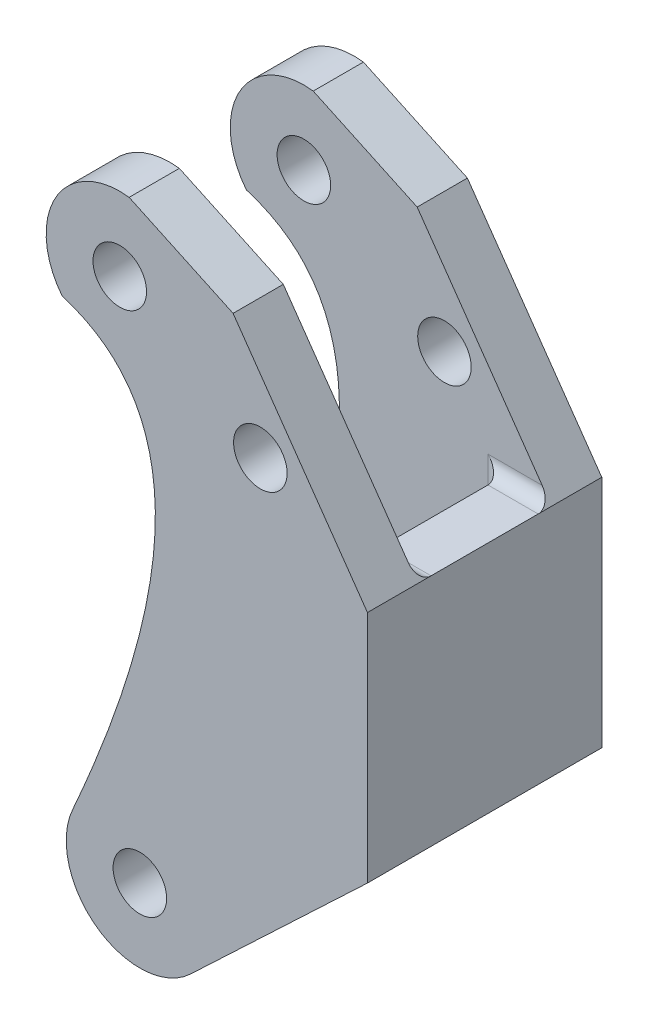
ISO-10303-21;
HEADER;
FILE_DESCRIPTION(('STEP AP214'),'2;1');
FILE_NAME('part.step','',(''),(''),'','','');
FILE_SCHEMA(('AUTOMOTIVE_DESIGN { 1 0 10303 214 1 1 1 1 }'));
ENDSEC;
DATA;
#1=APPLICATION_CONTEXT('core data for automotive mechanical design processes');
#2=APPLICATION_PROTOCOL_DEFINITION('international standard','automotive_design',2000,#1);
#3=PRODUCT_CONTEXT('',#1,'mechanical');
#4=PRODUCT('Part','Part','',(#3));
#5=PRODUCT_RELATED_PRODUCT_CATEGORY('part','',(#4));
#6=PRODUCT_DEFINITION_FORMATION('','',#4);
#7=PRODUCT_DEFINITION_CONTEXT('part definition',#1,'design');
#8=PRODUCT_DEFINITION('design','',#6,#7);
#9=PRODUCT_DEFINITION_SHAPE('','',#8);
#10=(LENGTH_UNIT() NAMED_UNIT(*) SI_UNIT(.MILLI.,.METRE.));
#11=(NAMED_UNIT(*) PLANE_ANGLE_UNIT() SI_UNIT($,.RADIAN.));
#12=(NAMED_UNIT(*) SI_UNIT($,.STERADIAN.) SOLID_ANGLE_UNIT());
#13=UNCERTAINTY_MEASURE_WITH_UNIT(LENGTH_MEASURE(1.E-05),#10,'distance_accuracy_value','');
#14=(GEOMETRIC_REPRESENTATION_CONTEXT(3) GLOBAL_UNCERTAINTY_ASSIGNED_CONTEXT((#13)) GLOBAL_UNIT_ASSIGNED_CONTEXT((#10,
#11,#12)) REPRESENTATION_CONTEXT('',''));
#15=CARTESIAN_POINT('',(0.,0.,0.));
#16=DIRECTION('',(0.,0.,1.));
#17=DIRECTION('',(1.,0.,0.));
#18=AXIS2_PLACEMENT_3D('',#15,#16,#17);
#19=CARTESIAN_POINT('',(-733376.145202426,-679839.483721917,35.));
#20=CARTESIAN_POINT('',(729354.890660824,684144.097201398,35.));
#21=CARTESIAN_POINT('',(-725481.74701469,-688256.591366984,35.));
#22=B_SPLINE_CURVE_WITH_KNOTS('',2,(#19,#20,#21),.UNSPECIFIED.,.F.,.F.,(3,3),(0.,1.),.UNSPECIFIED.);
#23=DIRECTION('',(0.,0.,-1.));
#24=VECTOR('',#23,1.);
#25=SURFACE_OF_LINEAR_EXTRUSION('',#22,#24);
#26=CARTESIAN_POINT('',(-733376.145202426,-679839.483721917,27.5));
#27=CARTESIAN_POINT('',(729354.890660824,684144.097201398,27.5));
#28=CARTESIAN_POINT('',(-725481.74701469,-688256.591366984,27.5));
#29=B_SPLINE_CURVE_WITH_KNOTS('',2,(#26,#27,#28),.UNSPECIFIED.,.F.,.F.,(3,3),(0.,1.),.UNSPECIFIED.);
#30=CARTESIAN_POINT('',(-45.5921431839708,53.1315885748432,27.5));
#31=VERTEX_POINT('',#30);
#32=CARTESIAN_POINT('',(-44.033482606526,-12.4912056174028,27.5));
#33=VERTEX_POINT('',#32);
#34=EDGE_CURVE('E236',#31,#33,#29,.T.);
#35=ORIENTED_EDGE('',*,*,#34,.T.);
#36=DIRECTION('',(0.,0.,-1.));
#37=VECTOR('',#36,1.);
#38=CARTESIAN_POINT('',(-44.0334826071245,-12.4912056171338,35.));
#39=LINE('',#38,#37);
#40=CARTESIAN_POINT('',(-44.0334826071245,-12.4912056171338,35.));
#41=VERTEX_POINT('',#40);
#42=EDGE_CURVE('E209',#41,#33,#39,.T.);
#43=ORIENTED_EDGE('',*,*,#42,.F.);
#44=CARTESIAN_POINT('',(-45.5921431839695,53.1315885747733,35.));
#45=VERTEX_POINT('',#44);
#46=EDGE_CURVE('E199',#45,#41,#22,.T.);
#47=ORIENTED_EDGE('',*,*,#46,.F.);
#48=DIRECTION('',(0.,0.,-1.));
#49=VECTOR('',#48,1.);
#50=CARTESIAN_POINT('',(-45.5921431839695,53.1315885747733,35.));
#51=LINE('',#50,#49);
#52=EDGE_CURVE('E216',#45,#31,#51,.T.);
#53=ORIENTED_EDGE('',*,*,#52,.T.);
#54=EDGE_LOOP('',(#35,#43,#47,#53));
#55=FACE_BOUND('',#54,.T.);
#56=ADVANCED_FACE('F34',(#55),#25,.F.);
#57=CARTESIAN_POINT('',(0.,0.,35.));
#58=DIRECTION('',(-0.686903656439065,0.726748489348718,0.));
#59=DIRECTION('',(-0.726748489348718,-0.686903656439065,0.));
#60=AXIS2_PLACEMENT_3D('',#57,#58,#59);
#61=PLANE('',#60);
#62=DIRECTION('',(0.,0.,-1.));
#63=VECTOR('',#62,1.);
#64=CARTESIAN_POINT('',(-26.4440597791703,-24.9942333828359,35.));
#65=LINE('',#64,#63);
#66=CARTESIAN_POINT('',(-26.4440597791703,-24.9942333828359,35.));
#67=VERTEX_POINT('',#66);
#68=CARTESIAN_POINT('',(-26.4440597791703,-24.9942333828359,27.5));
#69=VERTEX_POINT('',#68);
#70=EDGE_CURVE('E198',#67,#69,#65,.T.);
#71=ORIENTED_EDGE('',*,*,#70,.T.);
#72=DIRECTION('',(0.726748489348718,0.686903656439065,0.));
#73=VECTOR('',#72,1.);
#74=CARTESIAN_POINT('',(0.,0.,27.5));
#75=LINE('',#74,#73);
#76=CARTESIAN_POINT('',(-2.11601287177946,-2.,27.5));
#77=VERTEX_POINT('',#76);
#78=EDGE_CURVE('E421',#69,#77,#75,.T.);
#79=ORIENTED_EDGE('',*,*,#78,.T.);
#80=CARTESIAN_POINT('',(-2.11601287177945,-2.,25.5));
#81=DIRECTION('',(-0.686903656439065,0.726748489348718,0.));
#82=DIRECTION('',(-0.726748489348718,-0.686903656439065,0.));
#83=AXIS2_PLACEMENT_3D('',#80,#81,#82);
#84=ELLIPSE('',#83,2.91161647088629,2.);
#85=CARTESIAN_POINT('',(0.,0.,25.5));
#86=VERTEX_POINT('',#85);
#87=EDGE_CURVE('E289',#77,#86,#84,.T.);
#88=ORIENTED_EDGE('',*,*,#87,.T.);
#89=DIRECTION('',(0.,0.,-1.));
#90=VECTOR('',#89,1.);
#91=CARTESIAN_POINT('',(0.,0.,35.));
#92=LINE('',#91,#90);
#93=CARTESIAN_POINT('',(0.,0.,35.));
#94=VERTEX_POINT('',#93);
#95=EDGE_CURVE('E230',#94,#86,#92,.T.);
#96=ORIENTED_EDGE('',*,*,#95,.F.);
#97=DIRECTION('',(0.726748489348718,0.686903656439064,0.));
#98=VECTOR('',#97,1.);
#99=CARTESIAN_POINT('',(0.,0.,35.));
#100=LINE('',#99,#98);
#101=EDGE_CURVE('E341',#67,#94,#100,.T.);
#102=ORIENTED_EDGE('',*,*,#101,.F.);
#103=EDGE_LOOP('',(#71,#79,#88,#96,#102));
#104=FACE_BOUND('',#103,.T.);
#105=ADVANCED_FACE('F384',(#104),#61,.F.);
#106=CARTESIAN_POINT('',(-34.,-17.,35.));
#107=DIRECTION('',(0.,0.,-1.));
#108=DIRECTION('',(-1.,0.,0.));
#109=AXIS2_PLACEMENT_3D('',#106,#107,#108);
#110=CYLINDRICAL_SURFACE('',#109,11.);
#111=ORIENTED_EDGE('',*,*,#42,.T.);
#112=CARTESIAN_POINT('',(-34.,-17.,27.5));
#113=DIRECTION('',(0.,0.,1.));
#114=DIRECTION('',(1.,0.,0.));
#115=AXIS2_PLACEMENT_3D('',#112,#113,#114);
#116=CIRCLE('',#115,11.);
#117=EDGE_CURVE('E248',#33,#69,#116,.T.);
#118=ORIENTED_EDGE('',*,*,#117,.T.);
#119=ORIENTED_EDGE('',*,*,#70,.F.);
#120=CARTESIAN_POINT('',(-34.,-17.,35.));
#121=DIRECTION('',(0.,0.,1.));
#122=DIRECTION('',(1.,0.,0.));
#123=AXIS2_PLACEMENT_3D('',#120,#121,#122);
#124=CIRCLE('',#123,11.);
#125=EDGE_CURVE('E196',#41,#67,#124,.T.);
#126=ORIENTED_EDGE('',*,*,#125,.F.);
#127=EDGE_LOOP('',(#111,#118,#119,#126));
#128=FACE_BOUND('',#127,.T.);
#129=ADVANCED_FACE('F411',(#128),#110,.T.);
#130=CARTESIAN_POINT('',(0.,35.,35.));
#131=DIRECTION('',(-0.819152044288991,-0.573576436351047,0.));
#132=DIRECTION('',(0.573576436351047,-0.819152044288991,0.));
#133=AXIS2_PLACEMENT_3D('',#130,#131,#132);
#134=PLANE('',#133);
#135=DIRECTION('',(0.,0.,-1.));
#136=VECTOR('',#135,1.);
#137=CARTESIAN_POINT('',(0.,35.,35.));
#138=LINE('',#137,#136);
#139=CARTESIAN_POINT('',(0.,35.,35.));
#140=VERTEX_POINT('',#139);
#141=CARTESIAN_POINT('',(0.,35.,25.5));
#142=VERTEX_POINT('',#141);
#143=EDGE_CURVE('E227',#140,#142,#138,.T.);
#144=ORIENTED_EDGE('',*,*,#143,.T.);
#145=CARTESIAN_POINT('',(-1.40041507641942,37.,25.5));
#146=DIRECTION('',(-0.819152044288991,-0.573576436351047,0.));
#147=DIRECTION('',(-0.573576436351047,0.819152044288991,0.));
#148=AXIS2_PLACEMENT_3D('',#145,#146,#147);
#149=ELLIPSE('',#148,2.44154917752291,2.);
#150=CARTESIAN_POINT('',(-1.40041507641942,37.,27.5));
#151=VERTEX_POINT('',#150);
#152=EDGE_CURVE('E287',#142,#151,#149,.T.);
#153=ORIENTED_EDGE('',*,*,#152,.T.);
#154=DIRECTION('',(-0.573576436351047,0.819152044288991,0.));
#155=VECTOR('',#154,1.);
#156=CARTESIAN_POINT('',(0.,35.,27.5));
#157=LINE('',#156,#155);
#158=CARTESIAN_POINT('',(-20.0751752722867,63.6703215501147,27.5));
#159=VERTEX_POINT('',#158);
#160=EDGE_CURVE('E338',#151,#159,#157,.T.);
#161=ORIENTED_EDGE('',*,*,#160,.T.);
#162=DIRECTION('',(0.,0.,-1.));
#163=VECTOR('',#162,1.);
#164=CARTESIAN_POINT('',(-20.0751752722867,63.6703215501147,35.));
#165=LINE('',#164,#163);
#166=CARTESIAN_POINT('',(-20.0751752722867,63.6703215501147,35.));
#167=VERTEX_POINT('',#166);
#168=EDGE_CURVE('E224',#167,#159,#165,.T.);
#169=ORIENTED_EDGE('',*,*,#168,.F.);
#170=DIRECTION('',(-0.573576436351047,0.819152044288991,0.));
#171=VECTOR('',#170,1.);
#172=CARTESIAN_POINT('',(0.,35.,35.));
#173=LINE('',#172,#171);
#174=EDGE_CURVE('E346',#140,#167,#173,.T.);
#175=ORIENTED_EDGE('',*,*,#174,.F.);
#176=EDGE_LOOP('',(#144,#153,#161,#169,#175));
#177=FACE_BOUND('',#176,.T.);
#178=ADVANCED_FACE('F379',(#177),#134,.F.);
#179=CARTESIAN_POINT('',(-20.0751752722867,63.6703215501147,35.));
#180=DIRECTION('',(-0.422618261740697,-0.906307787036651,0.));
#181=DIRECTION('',(0.906307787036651,-0.422618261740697,0.));
#182=AXIS2_PLACEMENT_3D('',#179,#180,#181);
#183=PLANE('',#182);
#184=ORIENTED_EDGE('',*,*,#168,.T.);
#185=DIRECTION('',(-0.906307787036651,0.422618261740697,0.));
#186=VECTOR('',#185,1.);
#187=CARTESIAN_POINT('',(-20.0751752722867,63.6703215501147,27.5));
#188=LINE('',#187,#186);
#189=CARTESIAN_POINT('',(-35.6026001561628,70.9108786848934,27.5));
#190=VERTEX_POINT('',#189);
#191=EDGE_CURVE('E330',#159,#190,#188,.T.);
#192=ORIENTED_EDGE('',*,*,#191,.T.);
#193=DIRECTION('',(0.,0.,-1.));
#194=VECTOR('',#193,1.);
#195=CARTESIAN_POINT('',(-35.6026001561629,70.9108786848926,35.));
#196=LINE('',#195,#194);
#197=CARTESIAN_POINT('',(-35.6026001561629,70.9108786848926,35.));
#198=VERTEX_POINT('',#197);
#199=EDGE_CURVE('E220',#198,#190,#196,.T.);
#200=ORIENTED_EDGE('',*,*,#199,.F.);
#201=DIRECTION('',(-0.906307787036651,0.422618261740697,0.));
#202=VECTOR('',#201,1.);
#203=CARTESIAN_POINT('',(-20.0751752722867,63.6703215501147,35.));
#204=LINE('',#203,#202);
#205=EDGE_CURVE('E348',#167,#198,#204,.T.);
#206=ORIENTED_EDGE('',*,*,#205,.F.);
#207=EDGE_LOOP('',(#184,#192,#200,#206));
#208=FACE_BOUND('',#207,.T.);
#209=ADVANCED_FACE('F375',(#208),#183,.F.);
#210=CARTESIAN_POINT('',(-37.,60.,35.));
#211=DIRECTION('',(0.,0.,-1.));
#212=DIRECTION('',(-1.,0.,0.));
#213=AXIS2_PLACEMENT_3D('',#210,#211,#212);
#214=CYLINDRICAL_SURFACE('',#213,11.0000000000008);
#215=CARTESIAN_POINT('',(-37.,60.,7.5));
#216=DIRECTION('',(0.,0.,-1.));
#217=DIRECTION('',(-1.,0.,0.));
#218=AXIS2_PLACEMENT_3D('',#215,#216,#217);
#219=CIRCLE('',#218,11.0000000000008);
#220=CARTESIAN_POINT('',(-45.5921431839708,53.1315885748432,7.5));
#221=VERTEX_POINT('',#220);
#222=CARTESIAN_POINT('',(-35.6026001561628,70.9108786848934,7.5));
#223=VERTEX_POINT('',#222);
#224=EDGE_CURVE('E332',#221,#223,#219,.T.);
#225=ORIENTED_EDGE('',*,*,#224,.T.);
#226=CARTESIAN_POINT('',(-35.6026001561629,70.9108786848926,0.));
#227=VERTEX_POINT('',#226);
#228=EDGE_CURVE('E219',#223,#227,#196,.T.);
#229=ORIENTED_EDGE('',*,*,#228,.T.);
#230=CARTESIAN_POINT('',(-37.,60.,0.));
#231=DIRECTION('',(0.,0.,1.));
#232=DIRECTION('',(1.,0.,0.));
#233=AXIS2_PLACEMENT_3D('',#230,#231,#232);
#234=CIRCLE('',#233,11.0000000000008);
#235=CARTESIAN_POINT('',(-45.5921431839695,53.1315885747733,0.));
#236=VERTEX_POINT('',#235);
#237=EDGE_CURVE('E462',#227,#236,#234,.T.);
#238=ORIENTED_EDGE('',*,*,#237,.T.);
#239=EDGE_CURVE('E214',#221,#236,#51,.T.);
#240=ORIENTED_EDGE('',*,*,#239,.F.);
#241=EDGE_LOOP('',(#225,#229,#238,#240));
#242=FACE_BOUND('',#241,.T.);
#243=ADVANCED_FACE('F371',(#242),#214,.T.);
#244=CARTESIAN_POINT('',(-26.4440597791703,-24.9942333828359,7.5));
#245=VERTEX_POINT('',#244);
#246=CARTESIAN_POINT('',(-26.4440597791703,-24.9942333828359,6.25));
#247=VERTEX_POINT('',#246);
#248=EDGE_CURVE('E189',#245,#247,#65,.T.);
#249=ORIENTED_EDGE('',*,*,#248,.T.);
#250=CARTESIAN_POINT('',(-26.4440597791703,-24.9942333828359,3.75));
#251=DIRECTION('',(0.686903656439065,-0.726748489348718,0.));
#252=DIRECTION('',(0.726748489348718,0.686903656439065,0.));
#253=AXIS2_PLACEMENT_3D('',#250,#251,#252);
#254=CIRCLE('',#253,2.5);
#255=CARTESIAN_POINT('',(-26.4440597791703,-24.9942333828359,1.25));
#256=VERTEX_POINT('',#255);
#257=EDGE_CURVE('E50',#256,#247,#254,.T.);
#258=ORIENTED_EDGE('',*,*,#257,.F.);
#259=CARTESIAN_POINT('',(-26.4440597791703,-24.9942333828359,0.));
#260=VERTEX_POINT('',#259);
#261=EDGE_CURVE('E187',#256,#260,#65,.T.);
#262=ORIENTED_EDGE('',*,*,#261,.T.);
#263=DIRECTION('',(0.726748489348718,0.686903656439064,0.));
#264=VECTOR('',#263,1.);
#265=CARTESIAN_POINT('',(0.,0.,0.));
#266=LINE('',#265,#264);
#267=CARTESIAN_POINT('',(0.,0.,0.));
#268=VERTEX_POINT('',#267);
#269=EDGE_CURVE('E340',#260,#268,#266,.T.);
#270=ORIENTED_EDGE('',*,*,#269,.T.);
#271=CARTESIAN_POINT('',(0.,0.,9.5));
#272=VERTEX_POINT('',#271);
#273=EDGE_CURVE('E229',#272,#268,#92,.T.);
#274=ORIENTED_EDGE('',*,*,#273,.F.);
#275=CARTESIAN_POINT('',(-2.11601287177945,-2.,9.5));
#276=DIRECTION('',(-0.686903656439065,0.726748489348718,0.));
#277=DIRECTION('',(-0.726748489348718,-0.686903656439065,0.));
#278=AXIS2_PLACEMENT_3D('',#275,#276,#277);
#279=ELLIPSE('',#278,2.91161647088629,2.);
#280=CARTESIAN_POINT('',(-2.11601287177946,-2.,7.5));
#281=VERTEX_POINT('',#280);
#282=EDGE_CURVE('E43',#272,#281,#279,.T.);
#283=ORIENTED_EDGE('',*,*,#282,.T.);
#284=DIRECTION('',(-0.726748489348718,-0.686903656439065,0.));
#285=VECTOR('',#284,1.);
#286=CARTESIAN_POINT('',(0.,0.,7.5));
#287=LINE('',#286,#285);
#288=EDGE_CURVE('E445',#281,#245,#287,.T.);
#289=ORIENTED_EDGE('',*,*,#288,.T.);
#290=EDGE_LOOP('',(#249,#258,#262,#270,#274,#283,#289));
#291=FACE_BOUND('',#290,.T.);
#292=ADVANCED_FACE('F185',(#291),#61,.F.);
#293=CARTESIAN_POINT('',(0.,0.,35.));
#294=DIRECTION('',(-1.,0.,0.));
#295=DIRECTION('',(0.,0.,1.));
#296=AXIS2_PLACEMENT_3D('',#293,#294,#295);
#297=PLANE('',#296);
#298=DIRECTION('',(0.,1.,0.));
#299=VECTOR('',#298,1.);
#300=CARTESIAN_POINT('',(0.,0.,0.));
#301=LINE('',#300,#299);
#302=CARTESIAN_POINT('',(0.,35.,0.));
#303=VERTEX_POINT('',#302);
#304=EDGE_CURVE('E477',#268,#303,#301,.T.);
#305=ORIENTED_EDGE('',*,*,#304,.T.);
#306=CARTESIAN_POINT('',(0.,35.,9.5));
#307=VERTEX_POINT('',#306);
#308=EDGE_CURVE('E58',#307,#303,#138,.T.);
#309=ORIENTED_EDGE('',*,*,#308,.F.);
#310=DIRECTION('',(0.,0.,-1.));
#311=VECTOR('',#310,1.);
#312=CARTESIAN_POINT('',(0.,35.,27.5));
#313=LINE('',#312,#311);
#314=EDGE_CURVE('E444',#142,#307,#313,.T.);
#315=ORIENTED_EDGE('',*,*,#314,.F.);
#316=ORIENTED_EDGE('',*,*,#143,.F.);
#317=DIRECTION('',(0.,1.,0.));
#318=VECTOR('',#317,1.);
#319=CARTESIAN_POINT('',(0.,0.,35.));
#320=LINE('',#319,#318);
#321=EDGE_CURVE('E344',#94,#140,#320,.T.);
#322=ORIENTED_EDGE('',*,*,#321,.F.);
#323=ORIENTED_EDGE('',*,*,#95,.T.);
#324=DIRECTION('',(0.,0.,1.));
#325=VECTOR('',#324,1.);
#326=CARTESIAN_POINT('',(0.,0.,27.5));
#327=LINE('',#326,#325);
#328=EDGE_CURVE('E448',#272,#86,#327,.T.);
#329=ORIENTED_EDGE('',*,*,#328,.F.);
#330=ORIENTED_EDGE('',*,*,#273,.T.);
#331=EDGE_LOOP('',(#305,#309,#315,#316,#322,#323,#329,#330));
#332=FACE_BOUND('',#331,.T.);
#333=ADVANCED_FACE('F378',(#332),#297,.F.);
#334=CARTESIAN_POINT('',(-20.0751752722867,63.6703215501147,7.5));
#335=VERTEX_POINT('',#334);
#336=CARTESIAN_POINT('',(-20.0751752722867,63.6703215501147,0.));
#337=VERTEX_POINT('',#336);
#338=EDGE_CURVE('E223',#335,#337,#165,.T.);
#339=ORIENTED_EDGE('',*,*,#338,.F.);
#340=DIRECTION('',(0.573576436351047,-0.819152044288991,0.));
#341=VECTOR('',#340,1.);
#342=CARTESIAN_POINT('',(0.,35.,7.5));
#343=LINE('',#342,#341);
#344=CARTESIAN_POINT('',(-1.40041507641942,37.,7.5));
#345=VERTEX_POINT('',#344);
#346=EDGE_CURVE('E321',#335,#345,#343,.T.);
#347=ORIENTED_EDGE('',*,*,#346,.T.);
#348=CARTESIAN_POINT('',(-1.40041507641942,37.,9.5));
#349=DIRECTION('',(-0.819152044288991,-0.573576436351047,0.));
#350=DIRECTION('',(-0.573576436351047,0.819152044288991,0.));
#351=AXIS2_PLACEMENT_3D('',#348,#349,#350);
#352=ELLIPSE('',#351,2.44154917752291,2.);
#353=EDGE_CURVE('E11',#345,#307,#352,.T.);
#354=ORIENTED_EDGE('',*,*,#353,.T.);
#355=ORIENTED_EDGE('',*,*,#308,.T.);
#356=DIRECTION('',(-0.573576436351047,0.819152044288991,0.));
#357=VECTOR('',#356,1.);
#358=CARTESIAN_POINT('',(0.,35.,0.));
#359=LINE('',#358,#357);
#360=EDGE_CURVE('E463',#303,#337,#359,.T.);
#361=ORIENTED_EDGE('',*,*,#360,.T.);
#362=EDGE_LOOP('',(#339,#347,#354,#355,#361));
#363=FACE_BOUND('',#362,.T.);
#364=ADVANCED_FACE('F325',(#363),#134,.F.);
#365=ORIENTED_EDGE('',*,*,#228,.F.);
#366=DIRECTION('',(0.906307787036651,-0.422618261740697,0.));
#367=VECTOR('',#366,1.);
#368=CARTESIAN_POINT('',(-20.0751752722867,63.6703215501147,7.5));
#369=LINE('',#368,#367);
#370=EDGE_CURVE('E328',#223,#335,#369,.T.);
#371=ORIENTED_EDGE('',*,*,#370,.T.);
#372=ORIENTED_EDGE('',*,*,#338,.T.);
#373=DIRECTION('',(-0.906307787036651,0.422618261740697,0.));
#374=VECTOR('',#373,1.);
#375=CARTESIAN_POINT('',(-20.0751752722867,63.6703215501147,0.));
#376=LINE('',#375,#374);
#377=EDGE_CURVE('E458',#337,#227,#376,.T.);
#378=ORIENTED_EDGE('',*,*,#377,.T.);
#379=EDGE_LOOP('',(#365,#371,#372,#378));
#380=FACE_BOUND('',#379,.T.);
#381=ADVANCED_FACE('F369',(#380),#183,.F.);
#382=CARTESIAN_POINT('',(-37.,60.,27.5));
#383=DIRECTION('',(0.,0.,1.));
#384=DIRECTION('',(1.,0.,0.));
#385=AXIS2_PLACEMENT_3D('',#382,#383,#384);
#386=CIRCLE('',#385,11.0000000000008);
#387=EDGE_CURVE('E327',#190,#31,#386,.T.);
#388=ORIENTED_EDGE('',*,*,#387,.T.);
#389=ORIENTED_EDGE('',*,*,#52,.F.);
#390=CARTESIAN_POINT('',(-37.,60.,35.));
#391=DIRECTION('',(0.,0.,1.));
#392=DIRECTION('',(1.,0.,0.));
#393=AXIS2_PLACEMENT_3D('',#390,#391,#392);
#394=CIRCLE('',#393,11.0000000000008);
#395=EDGE_CURVE('E350',#198,#45,#394,.T.);
#396=ORIENTED_EDGE('',*,*,#395,.F.);
#397=ORIENTED_EDGE('',*,*,#199,.T.);
#398=EDGE_LOOP('',(#388,#389,#396,#397));
#399=FACE_BOUND('',#398,.T.);
#400=ADVANCED_FACE('F364',(#399),#214,.T.);
#401=CARTESIAN_POINT('',(-44.0334826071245,-12.4912056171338,7.5));
#402=VERTEX_POINT('',#401);
#403=CARTESIAN_POINT('',(-44.0334826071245,-12.4912056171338,0.));
#404=VERTEX_POINT('',#403);
#405=EDGE_CURVE('E204',#402,#404,#39,.T.);
#406=ORIENTED_EDGE('',*,*,#405,.F.);
#407=CARTESIAN_POINT('',(-733376.145202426,-679839.483721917,7.5));
#408=CARTESIAN_POINT('',(729354.890660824,684144.097201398,7.5));
#409=CARTESIAN_POINT('',(-725481.74701469,-688256.591366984,7.5));
#410=B_SPLINE_CURVE_WITH_KNOTS('',2,(#407,#408,#409),.UNSPECIFIED.,.F.,.F.,(3,3),(0.,1.),.UNSPECIFIED.);
#411=EDGE_CURVE('E232',#402,#221,#410,.F.);
#412=ORIENTED_EDGE('',*,*,#411,.T.);
#413=ORIENTED_EDGE('',*,*,#239,.T.);
#414=CARTESIAN_POINT('',(-733376.145202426,-679839.483721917,0.));
#415=CARTESIAN_POINT('',(729354.890660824,684144.097201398,0.));
#416=CARTESIAN_POINT('',(-725481.74701469,-688256.591366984,0.));
#417=B_SPLINE_CURVE_WITH_KNOTS('',2,(#414,#415,#416),.UNSPECIFIED.,.F.,.F.,(3,3),(0.,1.),.UNSPECIFIED.);
#418=EDGE_CURVE('E467',#236,#404,#417,.T.);
#419=ORIENTED_EDGE('',*,*,#418,.T.);
#420=EDGE_LOOP('',(#406,#412,#413,#419));
#421=FACE_BOUND('',#420,.T.);
#422=ADVANCED_FACE('F360',(#421),#25,.F.);
#423=ORIENTED_EDGE('',*,*,#261,.F.);
#424=CARTESIAN_POINT('',(-26.4440597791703,-24.9942333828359,6.25));
#425=CARTESIAN_POINT('',(-26.4944678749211,-25.0418864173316,6.25000773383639));
#426=CARTESIAN_POINT('',(-26.5453320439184,-25.0890506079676,6.24711302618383));
#427=CARTESIAN_POINT('',(-26.6475740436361,-25.1820885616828,6.23557870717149));
#428=CARTESIAN_POINT('',(-26.6989518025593,-25.2279625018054,6.2269398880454));
#429=CARTESIAN_POINT('',(-26.8017489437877,-25.3180436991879,6.20399686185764));
#430=CARTESIAN_POINT('',(-26.8531681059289,-25.3622536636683,6.18970233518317));
#431=CARTESIAN_POINT('',(-26.9557085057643,-25.4488146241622,6.15557718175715));
#432=CARTESIAN_POINT('',(-27.0068297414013,-25.4911656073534,6.13574651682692));
#433=CARTESIAN_POINT('',(-27.159131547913,-25.6150781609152,6.06815532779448));
#434=CARTESIAN_POINT('',(-27.2593389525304,-25.6935766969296,6.01227568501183));
#435=CARTESIAN_POINT('',(-27.4535747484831,-25.8407706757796,5.88059094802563));
#436=CARTESIAN_POINT('',(-27.5476021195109,-25.9094645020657,5.80478257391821));
#437=CARTESIAN_POINT('',(-27.7276749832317,-26.03716276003,5.63400285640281));
#438=CARTESIAN_POINT('',(-27.8135759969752,-26.0960024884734,5.53875553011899));
#439=CARTESIAN_POINT('',(-27.9725321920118,-26.2021079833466,5.33238964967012));
#440=CARTESIAN_POINT('',(-28.0455851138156,-26.2493717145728,5.22126831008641));
#441=CARTESIAN_POINT('',(-28.1767029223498,-26.3324877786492,4.98466486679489));
#442=CARTESIAN_POINT('',(-28.2345772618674,-26.3681962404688,4.85902631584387));
#443=CARTESIAN_POINT('',(-28.3315755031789,-26.4272057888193,4.5979832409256));
#444=CARTESIAN_POINT('',(-28.3707028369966,-26.4505091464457,4.46258050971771));
#445=CARTESIAN_POINT('',(-28.4278444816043,-26.4843121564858,4.18824239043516));
#446=CARTESIAN_POINT('',(-28.446200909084,-26.4950193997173,4.04940393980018));
#447=CARTESIAN_POINT('',(-28.4620562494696,-26.5042763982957,3.77014500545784));
#448=CARTESIAN_POINT('',(-28.4595574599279,-26.5028274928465,3.62972469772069));
#449=CARTESIAN_POINT('',(-28.4340916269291,-26.487932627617,3.35422655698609));
#450=CARTESIAN_POINT('',(-28.4115301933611,-26.4747244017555,3.21909798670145));
#451=CARTESIAN_POINT('',(-28.3475647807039,-26.4367021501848,2.95508445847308));
#452=CARTESIAN_POINT('',(-28.306159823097,-26.4118875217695,2.8261998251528));
#453=CARTESIAN_POINT('',(-28.2059144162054,-26.3505100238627,2.57705759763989));
#454=CARTESIAN_POINT('',(-28.1469279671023,-26.3138485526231,2.45688315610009));
#455=CARTESIAN_POINT('',(-28.0140993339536,-26.2290402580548,2.22949445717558));
#456=CARTESIAN_POINT('',(-27.9402553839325,-26.1808920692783,2.12228174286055));
#457=CARTESIAN_POINT('',(-27.7786660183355,-26.0721929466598,1.92123374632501));
#458=CARTESIAN_POINT('',(-27.6906368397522,-26.0113792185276,1.82776827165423));
#459=CARTESIAN_POINT('',(-27.5052356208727,-25.878682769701,1.65981207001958));
#460=CARTESIAN_POINT('',(-27.4078611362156,-25.8067971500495,1.58532632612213));
#461=CARTESIAN_POINT('',(-27.2069874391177,-25.6528054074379,1.45733768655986));
#462=CARTESIAN_POINT('',(-27.1034708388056,-25.5706694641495,1.40389798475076));
#463=CARTESIAN_POINT('',(-26.8942509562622,-25.3980136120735,1.32007427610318));
#464=CARTESIAN_POINT('',(-26.788551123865,-25.3075062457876,1.28965638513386));
#465=CARTESIAN_POINT('',(-26.6433346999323,-25.1781673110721,1.26415157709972));
#466=CARTESIAN_POINT('',(-26.6031648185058,-25.141853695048,1.25884327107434));
#467=CARTESIAN_POINT('',(-26.5232641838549,-25.0685406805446,1.25177173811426));
#468=CARTESIAN_POINT('',(-26.4835328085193,-25.0315425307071,1.25000259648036));
#469=CARTESIAN_POINT('',(-26.4440597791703,-24.9942333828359,1.24999999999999));
#470=B_SPLINE_CURVE_WITH_KNOTS('',3,(#424,#425,#426,#427,#428,#429,#430,#431,#432,#433,#434,
#435,#436,#437,#438,#439,#440,#441,#442,#443,#444,#445,#446,#447,#448,#449,#450,#451,#452,#453,
#454,#455,#456,#457,#458,#459,#460,#461,#462,#463,#464,#465,#466,#467,#468,#469),.UNSPECIFIED.,
.F.,.F.,(4,2,2,2,2,2,2,2,2,2,2,2,2,2,2,2,2,2,2,2,2,2,4),(0.,0.208030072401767,0.416031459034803,
0.623678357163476,0.831326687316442,1.2462696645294,1.66128097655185,2.08265515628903,
2.50410336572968,2.93061326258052,3.35704504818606,3.77634591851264,4.19560059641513,
4.60656710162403,5.01755495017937,5.43205559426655,5.8466055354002,6.27081242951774,
6.69513058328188,7.12071327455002,7.54566835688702,7.70880366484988,7.87166611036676),.UNSPECIFIED.);
#471=EDGE_CURVE('E177',#247,#256,#470,.T.);
#472=ORIENTED_EDGE('',*,*,#471,.F.);
#473=ORIENTED_EDGE('',*,*,#248,.F.);
#474=CARTESIAN_POINT('',(-34.,-17.,7.5));
#475=DIRECTION('',(0.,0.,-1.));
#476=DIRECTION('',(-1.,0.,0.));
#477=AXIS2_PLACEMENT_3D('',#474,#475,#476);
#478=CIRCLE('',#477,11.);
#479=EDGE_CURVE('E243',#245,#402,#478,.T.);
#480=ORIENTED_EDGE('',*,*,#479,.T.);
#481=ORIENTED_EDGE('',*,*,#405,.T.);
#482=CARTESIAN_POINT('',(-34.,-17.,0.));
#483=DIRECTION('',(0.,0.,1.));
#484=DIRECTION('',(1.,0.,0.));
#485=AXIS2_PLACEMENT_3D('',#482,#483,#484);
#486=CIRCLE('',#485,11.);
#487=EDGE_CURVE('E194',#404,#260,#486,.T.);
#488=ORIENTED_EDGE('',*,*,#487,.T.);
#489=EDGE_LOOP('',(#423,#472,#473,#480,#481,#488));
#490=FACE_BOUND('',#489,.T.);
#491=ADVANCED_FACE('F192',(#490),#110,.T.);
#492=CARTESIAN_POINT('',(-34.,-17.,35.));
#493=DIRECTION('',(0.,0.,1.));
#494=DIRECTION('',(1.,0.,0.));
#495=AXIS2_PLACEMENT_3D('',#492,#493,#494);
#496=PLANE('',#495);
#497=CARTESIAN_POINT('',(-16.,47.,35.));
#498=DIRECTION('',(0.,0.,1.));
#499=DIRECTION('',(1.,0.,0.));
#500=AXIS2_PLACEMENT_3D('',#497,#498,#499);
#501=CIRCLE('',#500,4.);
#502=CARTESIAN_POINT('',(-12.,47.,35.));
#503=VERTEX_POINT('',#502);
#504=EDGE_CURVE('E505',#503,#503,#501,.T.);
#505=ORIENTED_EDGE('',*,*,#504,.F.);
#506=EDGE_LOOP('',(#505));
#507=FACE_BOUND('',#506,.T.);
#508=CARTESIAN_POINT('',(-34.,-17.,35.));
#509=DIRECTION('',(0.,0.,-1.));
#510=DIRECTION('',(-1.,0.,0.));
#511=AXIS2_PLACEMENT_3D('',#508,#509,#510);
#512=CIRCLE('',#511,4.00000000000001);
#513=CARTESIAN_POINT('',(-38.,-17.,35.));
#514=VERTEX_POINT('',#513);
#515=EDGE_CURVE('E261',#514,#514,#512,.T.);
#516=ORIENTED_EDGE('',*,*,#515,.T.);
#517=EDGE_LOOP('',(#516));
#518=FACE_BOUND('',#517,.T.);
#519=CARTESIAN_POINT('',(-37.,60.,35.));
#520=DIRECTION('',(0.,0.,-1.));
#521=DIRECTION('',(-1.,0.,0.));
#522=AXIS2_PLACEMENT_3D('',#519,#520,#521);
#523=CIRCLE('',#522,4.00000000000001);
#524=CARTESIAN_POINT('',(-41.,60.,35.));
#525=VERTEX_POINT('',#524);
#526=EDGE_CURVE('E256',#525,#525,#523,.T.);
#527=ORIENTED_EDGE('',*,*,#526,.T.);
#528=EDGE_LOOP('',(#527));
#529=FACE_BOUND('',#528,.T.);
#530=ORIENTED_EDGE('',*,*,#101,.T.);
#531=ORIENTED_EDGE('',*,*,#321,.T.);
#532=ORIENTED_EDGE('',*,*,#174,.T.);
#533=ORIENTED_EDGE('',*,*,#205,.T.);
#534=ORIENTED_EDGE('',*,*,#395,.T.);
#535=ORIENTED_EDGE('',*,*,#46,.T.);
#536=ORIENTED_EDGE('',*,*,#125,.T.);
#537=EDGE_LOOP('',(#530,#531,#532,#533,#534,#535,#536));
#538=FACE_BOUND('',#537,.T.);
#539=ADVANCED_FACE('F424',(#507,#518,#529,#538),#496,.T.);
#540=CARTESIAN_POINT('',(-34.,-17.,0.));
#541=DIRECTION('',(0.,0.,1.));
#542=DIRECTION('',(1.,0.,0.));
#543=AXIS2_PLACEMENT_3D('',#540,#541,#542);
#544=PLANE('',#543);
#545=CARTESIAN_POINT('',(-16.,47.,0.));
#546=DIRECTION('',(0.,0.,1.));
#547=DIRECTION('',(1.,0.,0.));
#548=AXIS2_PLACEMENT_3D('',#545,#546,#547);
#549=CIRCLE('',#548,4.);
#550=CARTESIAN_POINT('',(-12.,47.,0.));
#551=VERTEX_POINT('',#550);
#552=EDGE_CURVE('E508',#551,#551,#549,.T.);
#553=ORIENTED_EDGE('',*,*,#552,.T.);
#554=EDGE_LOOP('',(#553));
#555=FACE_BOUND('',#554,.T.);
#556=CARTESIAN_POINT('',(-34.,-17.,0.));
#557=DIRECTION('',(0.,0.,-1.));
#558=DIRECTION('',(-1.,0.,0.));
#559=AXIS2_PLACEMENT_3D('',#556,#557,#558);
#560=CIRCLE('',#559,4.00000000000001);
#561=CARTESIAN_POINT('',(-38.,-17.,0.));
#562=VERTEX_POINT('',#561);
#563=EDGE_CURVE('E300',#562,#562,#560,.T.);
#564=ORIENTED_EDGE('',*,*,#563,.F.);
#565=EDGE_LOOP('',(#564));
#566=FACE_BOUND('',#565,.T.);
#567=CARTESIAN_POINT('',(-37.,60.,0.));
#568=DIRECTION('',(0.,0.,-1.));
#569=DIRECTION('',(-1.,0.,0.));
#570=AXIS2_PLACEMENT_3D('',#567,#568,#569);
#571=CIRCLE('',#570,4.00000000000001);
#572=CARTESIAN_POINT('',(-41.,60.,0.));
#573=VERTEX_POINT('',#572);
#574=EDGE_CURVE('E492',#573,#573,#571,.T.);
#575=ORIENTED_EDGE('',*,*,#574,.F.);
#576=EDGE_LOOP('',(#575));
#577=FACE_BOUND('',#576,.T.);
#578=ORIENTED_EDGE('',*,*,#269,.F.);
#579=ORIENTED_EDGE('',*,*,#487,.F.);
#580=ORIENTED_EDGE('',*,*,#418,.F.);
#581=ORIENTED_EDGE('',*,*,#237,.F.);
#582=ORIENTED_EDGE('',*,*,#377,.F.);
#583=ORIENTED_EDGE('',*,*,#360,.F.);
#584=ORIENTED_EDGE('',*,*,#304,.F.);
#585=EDGE_LOOP('',(#578,#579,#580,#581,#582,#583,#584));
#586=FACE_BOUND('',#585,.T.);
#587=ADVANCED_FACE('F466',(#555,#566,#577,#586),#544,.F.);
#588=CARTESIAN_POINT('',(-48.0000000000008,35.,27.5));
#589=DIRECTION('',(0.,0.,1.));
#590=DIRECTION('',(1.,0.,0.));
#591=AXIS2_PLACEMENT_3D('',#588,#589,#590);
#592=PLANE('',#591);
#593=CARTESIAN_POINT('',(-16.,47.,27.5));
#594=DIRECTION('',(0.,0.,1.));
#595=DIRECTION('',(1.,0.,0.));
#596=AXIS2_PLACEMENT_3D('',#593,#594,#595);
#597=CIRCLE('',#596,4.);
#598=CARTESIAN_POINT('',(-12.,47.,27.5));
#599=VERTEX_POINT('',#598);
#600=EDGE_CURVE('E303',#599,#599,#597,.T.);
#601=ORIENTED_EDGE('',*,*,#600,.T.);
#602=EDGE_LOOP('',(#601));
#603=FACE_BOUND('',#602,.T.);
#604=CARTESIAN_POINT('',(-34.,-17.,27.5));
#605=DIRECTION('',(0.,0.,1.));
#606=DIRECTION('',(1.,0.,0.));
#607=AXIS2_PLACEMENT_3D('',#604,#605,#606);
#608=CIRCLE('',#607,4.00000000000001);
#609=CARTESIAN_POINT('',(-30.,-17.,27.5));
#610=VERTEX_POINT('',#609);
#611=EDGE_CURVE('E260',#610,#610,#608,.T.);
#612=ORIENTED_EDGE('',*,*,#611,.T.);
#613=EDGE_LOOP('',(#612));
#614=FACE_BOUND('',#613,.T.);
#615=CARTESIAN_POINT('',(-37.,60.,27.5));
#616=DIRECTION('',(0.,0.,1.));
#617=DIRECTION('',(1.,0.,0.));
#618=AXIS2_PLACEMENT_3D('',#615,#616,#617);
#619=CIRCLE('',#618,4.00000000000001);
#620=CARTESIAN_POINT('',(-33.,60.,27.5));
#621=VERTEX_POINT('',#620);
#622=EDGE_CURVE('E255',#621,#621,#619,.T.);
#623=ORIENTED_EDGE('',*,*,#622,.T.);
#624=EDGE_LOOP('',(#623));
#625=FACE_BOUND('',#624,.T.);
#626=ORIENTED_EDGE('',*,*,#160,.F.);
#627=DIRECTION('',(1.,0.,0.));
#628=VECTOR('',#627,1.);
#629=CARTESIAN_POINT('',(-7.5,37.,27.5));
#630=LINE('',#629,#628);
#631=CARTESIAN_POINT('',(-9.5,37.,27.5));
#632=VERTEX_POINT('',#631);
#633=EDGE_CURVE('E270',#151,#632,#630,.F.);
#634=ORIENTED_EDGE('',*,*,#633,.T.);
#635=DIRECTION('',(0.,-1.,0.));
#636=VECTOR('',#635,1.);
#637=CARTESIAN_POINT('',(-9.5,0.,27.5));
#638=LINE('',#637,#636);
#639=CARTESIAN_POINT('',(-9.5,-2.,27.5));
#640=VERTEX_POINT('',#639);
#641=EDGE_CURVE('E268',#632,#640,#638,.T.);
#642=ORIENTED_EDGE('',*,*,#641,.T.);
#643=DIRECTION('',(1.,0.,0.));
#644=VECTOR('',#643,1.);
#645=CARTESIAN_POINT('',(0.,-2.,27.5));
#646=LINE('',#645,#644);
#647=EDGE_CURVE('E266',#640,#77,#646,.T.);
#648=ORIENTED_EDGE('',*,*,#647,.T.);
#649=ORIENTED_EDGE('',*,*,#78,.F.);
#650=ORIENTED_EDGE('',*,*,#117,.F.);
#651=ORIENTED_EDGE('',*,*,#34,.F.);
#652=ORIENTED_EDGE('',*,*,#387,.F.);
#653=ORIENTED_EDGE('',*,*,#191,.F.);
#654=EDGE_LOOP('',(#626,#634,#642,#648,#649,#650,#651,#652,#653));
#655=FACE_BOUND('',#654,.T.);
#656=ADVANCED_FACE('F420',(#603,#614,#625,#655),#592,.F.);
#657=CARTESIAN_POINT('',(-48.0000000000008,35.,7.5));
#658=DIRECTION('',(0.,0.,-1.));
#659=DIRECTION('',(-1.,0.,0.));
#660=AXIS2_PLACEMENT_3D('',#657,#658,#659);
#661=PLANE('',#660);
#662=CARTESIAN_POINT('',(-16.,47.,7.5));
#663=DIRECTION('',(0.,0.,-1.));
#664=DIRECTION('',(-1.,0.,0.));
#665=AXIS2_PLACEMENT_3D('',#662,#663,#664);
#666=CIRCLE('',#665,4.);
#667=CARTESIAN_POINT('',(-20.,47.,7.5));
#668=VERTEX_POINT('',#667);
#669=EDGE_CURVE('E38',#668,#668,#666,.T.);
#670=ORIENTED_EDGE('',*,*,#669,.T.);
#671=EDGE_LOOP('',(#670));
#672=FACE_BOUND('',#671,.T.);
#673=ORIENTED_EDGE('',*,*,#288,.F.);
#674=DIRECTION('',(1.,0.,0.));
#675=VECTOR('',#674,1.);
#676=CARTESIAN_POINT('',(-7.5,-2.,7.5));
#677=LINE('',#676,#675);
#678=CARTESIAN_POINT('',(-9.5,-2.,7.5));
#679=VERTEX_POINT('',#678);
#680=EDGE_CURVE('E285',#281,#679,#677,.F.);
#681=ORIENTED_EDGE('',*,*,#680,.T.);
#682=DIRECTION('',(0.,-1.,0.));
#683=VECTOR('',#682,1.);
#684=CARTESIAN_POINT('',(-9.5,35.,7.5));
#685=LINE('',#684,#683);
#686=CARTESIAN_POINT('',(-9.5,37.,7.5));
#687=VERTEX_POINT('',#686);
#688=EDGE_CURVE('E281',#679,#687,#685,.F.);
#689=ORIENTED_EDGE('',*,*,#688,.T.);
#690=DIRECTION('',(1.,0.,0.));
#691=VECTOR('',#690,1.);
#692=CARTESIAN_POINT('',(0.,37.,7.5));
#693=LINE('',#692,#691);
#694=EDGE_CURVE('E283',#687,#345,#693,.T.);
#695=ORIENTED_EDGE('',*,*,#694,.T.);
#696=ORIENTED_EDGE('',*,*,#346,.F.);
#697=ORIENTED_EDGE('',*,*,#370,.F.);
#698=ORIENTED_EDGE('',*,*,#224,.F.);
#699=ORIENTED_EDGE('',*,*,#411,.F.);
#700=ORIENTED_EDGE('',*,*,#479,.F.);
#701=EDGE_LOOP('',(#673,#681,#689,#695,#696,#697,#698,#699,#700));
#702=FACE_BOUND('',#701,.T.);
#703=CARTESIAN_POINT('',(-34.,-17.,7.5));
#704=DIRECTION('',(0.,0.,-1.));
#705=DIRECTION('',(-1.,0.,0.));
#706=AXIS2_PLACEMENT_3D('',#703,#704,#705);
#707=CIRCLE('',#706,4.00000000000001);
#708=CARTESIAN_POINT('',(-38.,-17.,7.5));
#709=VERTEX_POINT('',#708);
#710=EDGE_CURVE('E257',#709,#709,#707,.T.);
#711=ORIENTED_EDGE('',*,*,#710,.T.);
#712=EDGE_LOOP('',(#711));
#713=FACE_BOUND('',#712,.T.);
#714=CARTESIAN_POINT('',(-37.,60.,7.5));
#715=DIRECTION('',(0.,0.,-1.));
#716=DIRECTION('',(-1.,0.,0.));
#717=AXIS2_PLACEMENT_3D('',#714,#715,#716);
#718=CIRCLE('',#717,4.00000000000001);
#719=CARTESIAN_POINT('',(-41.,60.,7.5));
#720=VERTEX_POINT('',#719);
#721=EDGE_CURVE('E252',#720,#720,#718,.T.);
#722=ORIENTED_EDGE('',*,*,#721,.T.);
#723=EDGE_LOOP('',(#722));
#724=FACE_BOUND('',#723,.T.);
#725=ADVANCED_FACE('F318',(#672,#702,#713,#724),#661,.F.);
#726=CARTESIAN_POINT('',(-48.0000000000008,35.,27.5));
#727=DIRECTION('',(0.,-1.,0.));
#728=DIRECTION('',(0.,0.,-1.));
#729=AXIS2_PLACEMENT_3D('',#726,#727,#728);
#730=PLANE('',#729);
#731=DIRECTION('',(0.,0.,1.));
#732=VECTOR('',#731,1.);
#733=CARTESIAN_POINT('',(-7.5,35.,27.5));
#734=LINE('',#733,#732);
#735=CARTESIAN_POINT('',(-7.5,35.,9.5));
#736=VERTEX_POINT('',#735);
#737=CARTESIAN_POINT('',(-7.5,35.,25.5));
#738=VERTEX_POINT('',#737);
#739=EDGE_CURVE('E483',#736,#738,#734,.T.);
#740=ORIENTED_EDGE('',*,*,#739,.T.);
#741=DIRECTION('',(1.,0.,0.));
#742=VECTOR('',#741,1.);
#743=CARTESIAN_POINT('',(0.,35.,25.5));
#744=LINE('',#743,#742);
#745=EDGE_CURVE('E263',#738,#142,#744,.T.);
#746=ORIENTED_EDGE('',*,*,#745,.T.);
#747=ORIENTED_EDGE('',*,*,#314,.T.);
#748=DIRECTION('',(1.,0.,0.));
#749=VECTOR('',#748,1.);
#750=CARTESIAN_POINT('',(-7.5,35.,9.5));
#751=LINE('',#750,#749);
#752=EDGE_CURVE('E251',#307,#736,#751,.F.);
#753=ORIENTED_EDGE('',*,*,#752,.T.);
#754=EDGE_LOOP('',(#740,#746,#747,#753));
#755=FACE_BOUND('',#754,.T.);
#756=ADVANCED_FACE('F537',(#755),#730,.F.);
#757=CARTESIAN_POINT('',(-48.0000000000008,0.,27.5));
#758=DIRECTION('',(0.,1.,0.));
#759=DIRECTION('',(0.,0.,1.));
#760=AXIS2_PLACEMENT_3D('',#757,#758,#759);
#761=PLANE('',#760);
#762=ORIENTED_EDGE('',*,*,#328,.T.);
#763=DIRECTION('',(1.,0.,0.));
#764=VECTOR('',#763,1.);
#765=CARTESIAN_POINT('',(-7.5,0.,25.5));
#766=LINE('',#765,#764);
#767=CARTESIAN_POINT('',(-7.5,0.,25.5));
#768=VERTEX_POINT('',#767);
#769=EDGE_CURVE('E279',#86,#768,#766,.F.);
#770=ORIENTED_EDGE('',*,*,#769,.T.);
#771=DIRECTION('',(0.,0.,1.));
#772=VECTOR('',#771,1.);
#773=CARTESIAN_POINT('',(-7.5,0.,27.5));
#774=LINE('',#773,#772);
#775=CARTESIAN_POINT('',(-7.5,0.,9.5));
#776=VERTEX_POINT('',#775);
#777=EDGE_CURVE('E485',#776,#768,#774,.T.);
#778=ORIENTED_EDGE('',*,*,#777,.F.);
#779=DIRECTION('',(1.,0.,0.));
#780=VECTOR('',#779,1.);
#781=CARTESIAN_POINT('',(0.,0.,9.5));
#782=LINE('',#781,#780);
#783=EDGE_CURVE('E276',#776,#272,#782,.T.);
#784=ORIENTED_EDGE('',*,*,#783,.T.);
#785=EDGE_LOOP('',(#762,#770,#778,#784));
#786=FACE_BOUND('',#785,.T.);
#787=ADVANCED_FACE('F552',(#786),#761,.F.);
#788=CARTESIAN_POINT('',(-7.5,71.0000000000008,27.5));
#789=DIRECTION('',(1.,0.,0.));
#790=DIRECTION('',(0.,0.,-1.));
#791=AXIS2_PLACEMENT_3D('',#788,#789,#790);
#792=PLANE('',#791);
#793=ORIENTED_EDGE('',*,*,#777,.T.);
#794=DIRECTION('',(0.,-1.,0.));
#795=VECTOR('',#794,1.);
#796=CARTESIAN_POINT('',(-7.5,35.,25.5));
#797=LINE('',#796,#795);
#798=EDGE_CURVE('E274',#768,#738,#797,.F.);
#799=ORIENTED_EDGE('',*,*,#798,.T.);
#800=ORIENTED_EDGE('',*,*,#739,.F.);
#801=DIRECTION('',(0.,-1.,0.));
#802=VECTOR('',#801,1.);
#803=CARTESIAN_POINT('',(-7.5,0.,9.5));
#804=LINE('',#803,#802);
#805=EDGE_CURVE('E272',#736,#776,#804,.T.);
#806=ORIENTED_EDGE('',*,*,#805,.T.);
#807=EDGE_LOOP('',(#793,#799,#800,#806));
#808=FACE_BOUND('',#807,.T.);
#809=ADVANCED_FACE('F544',(#808),#792,.F.);
#810=CARTESIAN_POINT('',(-37.,60.,35.));
#811=DIRECTION('',(0.,0.,-1.));
#812=DIRECTION('',(-1.,0.,0.));
#813=AXIS2_PLACEMENT_3D('',#810,#811,#812);
#814=CYLINDRICAL_SURFACE('',#813,4.00000000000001);
#815=ORIENTED_EDGE('',*,*,#574,.T.);
#816=EDGE_LOOP('',(#815));
#817=FACE_BOUND('',#816,.T.);
#818=ORIENTED_EDGE('',*,*,#721,.F.);
#819=EDGE_LOOP('',(#818));
#820=FACE_BOUND('',#819,.T.);
#821=ADVANCED_FACE('F542',(#817,#820),#814,.F.);
#822=ORIENTED_EDGE('',*,*,#526,.F.);
#823=EDGE_LOOP('',(#822));
#824=FACE_BOUND('',#823,.T.);
#825=ORIENTED_EDGE('',*,*,#622,.F.);
#826=EDGE_LOOP('',(#825));
#827=FACE_BOUND('',#826,.T.);
#828=ADVANCED_FACE('F530',(#824,#827),#814,.F.);
#829=CARTESIAN_POINT('',(-34.,-17.,35.));
#830=DIRECTION('',(0.,0.,-1.));
#831=DIRECTION('',(-1.,0.,0.));
#832=AXIS2_PLACEMENT_3D('',#829,#830,#831);
#833=CYLINDRICAL_SURFACE('',#832,4.00000000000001);
#834=CARTESIAN_POINT('',(-30.038272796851,-17.5520122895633,3.75));
#835=CARTESIAN_POINT('',(-30.038272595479,-17.5520133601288,3.68784324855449));
#836=CARTESIAN_POINT('',(-30.0386801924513,-17.5549648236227,3.62567405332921));
#837=CARTESIAN_POINT('',(-30.0403384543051,-17.5666654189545,3.50188282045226));
#838=CARTESIAN_POINT('',(-30.0415896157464,-17.5754179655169,3.4402611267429));
#839=CARTESIAN_POINT('',(-30.0467239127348,-17.6100731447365,3.25677395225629));
#840=CARTESIAN_POINT('',(-30.0519881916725,-17.6443723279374,3.13645166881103));
#841=CARTESIAN_POINT('',(-30.0671954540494,-17.7313945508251,2.90440180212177));
#842=CARTESIAN_POINT('',(-30.0770980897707,-17.7839577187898,2.7926095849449));
#843=CARTESIAN_POINT('',(-30.102936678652,-17.9036867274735,2.57799147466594));
#844=CARTESIAN_POINT('',(-30.1188727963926,-17.9708529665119,2.47516582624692));
#845=CARTESIAN_POINT('',(-30.1608695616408,-18.1262211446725,2.26626601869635));
#846=CARTESIAN_POINT('',(-30.1880016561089,-18.2160363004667,2.16160667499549));
#847=CARTESIAN_POINT('',(-30.253918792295,-18.4060684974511,1.96623844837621));
#848=CARTESIAN_POINT('',(-30.2927139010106,-18.5062944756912,1.87554172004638));
#849=CARTESIAN_POINT('',(-30.389381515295,-18.7261105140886,1.69977970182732));
#850=CARTESIAN_POINT('',(-30.4489909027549,-18.8465779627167,1.61671381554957));
#851=CARTESIAN_POINT('',(-30.5523011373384,-19.0293617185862,1.50945484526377));
#852=CARTESIAN_POINT('',(-30.589066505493,-19.090654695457,1.47658486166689));
#853=CARTESIAN_POINT('',(-30.6673007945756,-19.2132293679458,1.41704531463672));
#854=CARTESIAN_POINT('',(-30.7087664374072,-19.2745110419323,1.39037146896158));
#855=CARTESIAN_POINT('',(-30.791902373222,-19.3901165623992,1.34601618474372));
#856=CARTESIAN_POINT('',(-30.8331275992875,-19.4445171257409,1.32769802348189));
#857=CARTESIAN_POINT('',(-30.9191333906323,-19.55205742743,1.29669771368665));
#858=CARTESIAN_POINT('',(-30.9639118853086,-19.6051978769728,1.28401231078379));
#859=CARTESIAN_POINT('',(-31.056733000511,-19.7096221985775,1.26448620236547));
#860=CARTESIAN_POINT('',(-31.104773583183,-19.7609071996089,1.25764188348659));
#861=CARTESIAN_POINT('',(-31.203715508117,-19.861076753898,1.24990078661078));
#862=CARTESIAN_POINT('',(-31.2546165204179,-19.9099615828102,1.24900332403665));
#863=CARTESIAN_POINT('',(-31.3968907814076,-20.0395103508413,1.25472537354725));
#864=CARTESIAN_POINT('',(-31.4906990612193,-20.1173403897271,1.26730650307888));
#865=CARTESIAN_POINT('',(-31.6823980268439,-20.2623937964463,1.30973021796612));
#866=CARTESIAN_POINT('',(-31.7802890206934,-20.3296163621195,1.33957410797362));
#867=CARTESIAN_POINT('',(-31.9772877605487,-20.4528496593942,1.41520855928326));
#868=CARTESIAN_POINT('',(-32.0763979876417,-20.508831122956,1.46103991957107));
#869=CARTESIAN_POINT('',(-32.2726635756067,-20.6095007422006,1.56693723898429));
#870=CARTESIAN_POINT('',(-32.3698184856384,-20.6541863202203,1.62700644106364));
#871=CARTESIAN_POINT('',(-32.5714318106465,-20.737986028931,1.76805641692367));
#872=CARTESIAN_POINT('',(-32.6752944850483,-20.7757147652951,1.85070927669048));
#873=CARTESIAN_POINT('',(-32.8740366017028,-20.8396789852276,2.03026473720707));
#874=CARTESIAN_POINT('',(-32.9689026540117,-20.8658975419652,2.12718804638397));
#875=CARTESIAN_POINT('',(-33.1575995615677,-20.9116433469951,2.34741125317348));
#876=CARTESIAN_POINT('',(-33.2496774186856,-20.9298496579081,2.47250276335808));
#877=CARTESIAN_POINT('',(-33.4113959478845,-20.9573092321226,2.73729223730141));
#878=CARTESIAN_POINT('',(-33.4810779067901,-20.9665790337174,2.8769626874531));
#879=CARTESIAN_POINT('',(-33.5762923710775,-20.9777051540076,3.12953880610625));
#880=CARTESIAN_POINT('',(-33.6086164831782,-20.9808700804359,3.23982192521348));
#881=CARTESIAN_POINT('',(-33.6543750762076,-20.9851087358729,3.46423037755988));
#882=CARTESIAN_POINT('',(-33.6678353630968,-20.9861853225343,3.5783502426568));
#883=CARTESIAN_POINT('',(-33.6745302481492,-20.9867386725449,3.80745736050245));
#884=CARTESIAN_POINT('',(-33.6677184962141,-20.9862117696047,3.92244600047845));
#885=CARTESIAN_POINT('',(-33.6344982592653,-20.983298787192,4.14956116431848));
#886=CARTESIAN_POINT('',(-33.6080735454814,-20.9809111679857,4.26168523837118));
#887=CARTESIAN_POINT('',(-33.5386553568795,-20.9734542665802,4.47843675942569));
#888=CARTESIAN_POINT('',(-33.4959421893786,-20.9684298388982,4.58315731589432));
#889=CARTESIAN_POINT('',(-33.3968154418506,-20.9545755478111,4.78557469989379));
#890=CARTESIAN_POINT('',(-33.3403969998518,-20.9457443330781,4.88326901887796));
#891=CARTESIAN_POINT('',(-33.2047479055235,-20.9208646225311,5.08861194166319));
#892=CARTESIAN_POINT('',(-33.1232191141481,-20.9037621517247,5.19461452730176));
#893=CARTESIAN_POINT('',(-32.9483363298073,-20.8603283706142,5.39437066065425));
#894=CARTESIAN_POINT('',(-32.8549700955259,-20.8339874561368,5.48811132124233));
#895=CARTESIAN_POINT('',(-32.644026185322,-20.7650421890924,5.67596407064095));
#896=CARTESIAN_POINT('',(-32.5249664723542,-20.7205077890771,5.7677273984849));
#897=CARTESIAN_POINT('',(-32.2802508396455,-20.6138881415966,5.93014701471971));
#898=CARTESIAN_POINT('',(-32.1545980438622,-20.5518111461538,6.00081319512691));
#899=CARTESIAN_POINT('',(-31.9693608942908,-20.446909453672,6.08658106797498));
#900=CARTESIAN_POINT('',(-31.9100017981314,-20.4112807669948,6.11129744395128));
#901=CARTESIAN_POINT('',(-31.7917585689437,-20.3359509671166,6.15493827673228));
#902=CARTESIAN_POINT('',(-31.7328741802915,-20.2962522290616,6.17386608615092));
#903=CARTESIAN_POINT('',(-31.6162974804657,-20.2129563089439,6.20560583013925));
#904=CARTESIAN_POINT('',(-31.5586041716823,-20.1693625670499,6.21842309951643));
#905=CARTESIAN_POINT('',(-31.4450611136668,-20.0785682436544,6.2377391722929));
#906=CARTESIAN_POINT('',(-31.3892110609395,-20.0313682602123,6.24423902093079));
#907=CARTESIAN_POINT('',(-31.241541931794,-19.8993803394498,6.25307151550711));
#908=CARTESIAN_POINT('',(-31.1520271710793,-19.8114872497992,6.24926579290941));
#909=CARTESIAN_POINT('',(-30.9829630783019,-19.6292535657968,6.22308241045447));
#910=CARTESIAN_POINT('',(-30.9034132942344,-19.5349132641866,6.2007055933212));
#911=CARTESIAN_POINT('',(-30.7583897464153,-19.3464058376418,6.13967758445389));
#912=CARTESIAN_POINT('',(-30.6925233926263,-19.2523462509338,6.10161792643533));
#913=CARTESIAN_POINT('',(-30.5719414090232,-19.0641993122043,6.01088053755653));
#914=CARTESIAN_POINT('',(-30.5172276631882,-18.970111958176,5.9582003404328));
#915=CARTESIAN_POINT('',(-30.4134748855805,-18.7749049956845,5.83367872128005));
#916=CARTESIAN_POINT('',(-30.3656143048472,-18.6740691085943,5.76041600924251));
#917=CARTESIAN_POINT('',(-30.2818384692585,-18.4787152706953,5.5998467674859));
#918=CARTESIAN_POINT('',(-30.2459368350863,-18.3842046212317,5.51252439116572));
#919=CARTESIAN_POINT('',(-30.1801287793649,-18.1917806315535,5.31176748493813));
#920=CARTESIAN_POINT('',(-30.1518324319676,-18.0953404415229,5.19638338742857));
#921=CARTESIAN_POINT('',(-30.1062764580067,-17.920378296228,4.95071059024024));
#922=CARTESIAN_POINT('',(-30.0890107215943,-17.8418464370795,4.82043018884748));
#923=CARTESIAN_POINT('',(-30.065698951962,-17.7239225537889,4.57719469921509));
#924=CARTESIAN_POINT('',(-30.0580206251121,-17.6797211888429,4.46672942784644));
#925=CARTESIAN_POINT('',(-30.0465930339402,-17.6098036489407,4.24006065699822));
#926=CARTESIAN_POINT('',(-30.0428313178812,-17.584028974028,4.12387658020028));
#927=CARTESIAN_POINT('',(-30.0398406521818,-17.56316682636,3.96394000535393));
#928=CARTESIAN_POINT('',(-30.0392510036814,-17.5589925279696,3.92127447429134));
#929=CARTESIAN_POINT('',(-30.0384670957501,-17.5534145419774,3.83574130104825));
#930=CARTESIAN_POINT('',(-30.0382729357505,-17.5520115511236,3.79287361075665));
#931=CARTESIAN_POINT('',(-30.038272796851,-17.5520122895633,3.75));
#932=B_SPLINE_CURVE_WITH_KNOTS('',3,(#834,#835,#836,#837,#838,#839,#840,#841,#842,#843,#844,
#845,#846,#847,#848,#849,#850,#851,#852,#853,#854,#855,#856,#857,#858,#859,#860,#861,#862,#863,
#864,#865,#866,#867,#868,#869,#870,#871,#872,#873,#874,#875,#876,#877,#878,#879,#880,#881,#882,
#883,#884,#885,#886,#887,#888,#889,#890,#891,#892,#893,#894,#895,#896,#897,#898,#899,#900,#901,
#902,#903,#904,#905,#906,#907,#908,#909,#910,#911,#912,#913,#914,#915,#916,#917,#918,#919,#920,
#921,#922,#923,#924,#925,#926,#927,#928,#929,#930,#931),.UNSPECIFIED.,.T.,.F.,(4,2,2,2,2,2,2,2,
2,2,2,2,2,2,2,2,2,2,2,2,2,2,2,2,2,2,2,2,2,2,2,2,2,2,2,2,2,2,2,2,2,2,2,2,2,2,2,2,4),(0.,
0.186415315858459,0.372940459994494,0.746478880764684,1.11682668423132,1.48718459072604,
1.9072279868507,2.32763499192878,2.79876029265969,3.03445880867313,3.26999394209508,
3.48170145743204,3.69328649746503,3.90474055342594,4.11617026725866,4.48184709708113,
4.84755156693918,5.21419620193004,5.58092442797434,5.99329080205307,6.40626158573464,
6.87316206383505,7.33919680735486,7.68265621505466,8.02564530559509,8.36941921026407,
8.7134778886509,9.05186495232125,9.39037223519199,9.79332737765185,10.1967026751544,
10.6647326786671,11.1325428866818,11.3527929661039,11.5729152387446,11.7928449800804,
12.0127383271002,12.3871595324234,12.7615637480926,13.1229788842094,13.4844550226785,
13.8834503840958,14.2828986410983,14.7399238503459,15.1966956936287,15.5530255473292,
15.9082190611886,16.0367696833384,16.1653526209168),.UNSPECIFIED.);
#933=CARTESIAN_POINT('',(-30.038272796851,-17.5520122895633,3.75));
#934=VERTEX_POINT('',#933);
#935=EDGE_CURVE('E190',#934,#934,#932,.T.);
#936=ORIENTED_EDGE('',*,*,#935,.F.);
#937=EDGE_LOOP('',(#936));
#938=FACE_BOUND('',#937,.T.);
#939=ORIENTED_EDGE('',*,*,#563,.T.);
#940=EDGE_LOOP('',(#939));
#941=FACE_BOUND('',#940,.T.);
#942=ORIENTED_EDGE('',*,*,#710,.F.);
#943=EDGE_LOOP('',(#942));
#944=FACE_BOUND('',#943,.T.);
#945=ADVANCED_FACE('F527',(#938,#941,#944),#833,.F.);
#946=ORIENTED_EDGE('',*,*,#515,.F.);
#947=EDGE_LOOP('',(#946));
#948=FACE_BOUND('',#947,.T.);
#949=ORIENTED_EDGE('',*,*,#611,.F.);
#950=EDGE_LOOP('',(#949));
#951=FACE_BOUND('',#950,.T.);
#952=ADVANCED_FACE('F396',(#948,#951),#833,.F.);
#953=CARTESIAN_POINT('',(-48.0000000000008,-2.,25.5));
#954=DIRECTION('',(-1.,0.,0.));
#955=DIRECTION('',(0.,0.,1.));
#956=AXIS2_PLACEMENT_3D('',#953,#954,#955);
#957=CYLINDRICAL_SURFACE('',#956,2.);
#958=ORIENTED_EDGE('',*,*,#87,.F.);
#959=ORIENTED_EDGE('',*,*,#647,.F.);
#960=CARTESIAN_POINT('',(-9.5,-2.,25.5));
#961=DIRECTION('',(-0.707106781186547,0.707106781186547,0.));
#962=DIRECTION('',(-0.707106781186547,-0.707106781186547,0.));
#963=AXIS2_PLACEMENT_3D('',#960,#961,#962);
#964=ELLIPSE('',#963,2.82842712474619,2.);
#965=EDGE_CURVE('E296',#768,#640,#964,.F.);
#966=ORIENTED_EDGE('',*,*,#965,.F.);
#967=ORIENTED_EDGE('',*,*,#769,.F.);
#968=EDGE_LOOP('',(#958,#959,#966,#967));
#969=FACE_BOUND('',#968,.T.);
#970=ADVANCED_FACE('F392',(#969),#957,.F.);
#971=CARTESIAN_POINT('',(-9.5,35.,25.5));
#972=DIRECTION('',(0.,1.,0.));
#973=DIRECTION('',(0.,0.,1.));
#974=AXIS2_PLACEMENT_3D('',#971,#972,#973);
#975=CYLINDRICAL_SURFACE('',#974,2.);
#976=ORIENTED_EDGE('',*,*,#965,.T.);
#977=ORIENTED_EDGE('',*,*,#641,.F.);
#978=CARTESIAN_POINT('',(-9.5,37.,25.5));
#979=DIRECTION('',(0.707106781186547,0.707106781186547,0.));
#980=DIRECTION('',(-0.707106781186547,0.707106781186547,0.));
#981=AXIS2_PLACEMENT_3D('',#978,#979,#980);
#982=ELLIPSE('',#981,2.82842712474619,2.);
#983=EDGE_CURVE('E293',#738,#632,#982,.F.);
#984=ORIENTED_EDGE('',*,*,#983,.F.);
#985=ORIENTED_EDGE('',*,*,#798,.F.);
#986=EDGE_LOOP('',(#976,#977,#984,#985));
#987=FACE_BOUND('',#986,.T.);
#988=ADVANCED_FACE('F388',(#987),#975,.F.);
#989=CARTESIAN_POINT('',(-48.0000000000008,37.,25.5));
#990=DIRECTION('',(-1.,0.,0.));
#991=DIRECTION('',(0.,0.,1.));
#992=AXIS2_PLACEMENT_3D('',#989,#990,#991);
#993=CYLINDRICAL_SURFACE('',#992,2.);
#994=ORIENTED_EDGE('',*,*,#983,.T.);
#995=ORIENTED_EDGE('',*,*,#633,.F.);
#996=ORIENTED_EDGE('',*,*,#152,.F.);
#997=ORIENTED_EDGE('',*,*,#745,.F.);
#998=EDGE_LOOP('',(#994,#995,#996,#997));
#999=FACE_BOUND('',#998,.T.);
#1000=ADVANCED_FACE('F385',(#999),#993,.F.);
#1001=CARTESIAN_POINT('',(-48.0000000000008,37.,9.5));
#1002=DIRECTION('',(-1.,0.,0.));
#1003=DIRECTION('',(0.,0.,1.));
#1004=AXIS2_PLACEMENT_3D('',#1001,#1002,#1003);
#1005=CYLINDRICAL_SURFACE('',#1004,2.);
#1006=ORIENTED_EDGE('',*,*,#353,.F.);
#1007=ORIENTED_EDGE('',*,*,#694,.F.);
#1008=CARTESIAN_POINT('',(-9.5,37.,9.5));
#1009=DIRECTION('',(0.707106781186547,0.707106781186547,0.));
#1010=DIRECTION('',(-0.707106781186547,0.707106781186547,0.));
#1011=AXIS2_PLACEMENT_3D('',#1008,#1009,#1010);
#1012=ELLIPSE('',#1011,2.82842712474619,2.);
#1013=EDGE_CURVE('E297',#736,#687,#1012,.T.);
#1014=ORIENTED_EDGE('',*,*,#1013,.F.);
#1015=ORIENTED_EDGE('',*,*,#752,.F.);
#1016=EDGE_LOOP('',(#1006,#1007,#1014,#1015));
#1017=FACE_BOUND('',#1016,.T.);
#1018=ADVANCED_FACE('F36',(#1017),#1005,.F.);
#1019=CARTESIAN_POINT('',(-9.5,71.0000000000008,9.5));
#1020=DIRECTION('',(0.,1.,0.));
#1021=DIRECTION('',(0.,0.,1.));
#1022=AXIS2_PLACEMENT_3D('',#1019,#1020,#1021);
#1023=CYLINDRICAL_SURFACE('',#1022,2.);
#1024=ORIENTED_EDGE('',*,*,#1013,.T.);
#1025=ORIENTED_EDGE('',*,*,#688,.F.);
#1026=CARTESIAN_POINT('',(-9.5,-2.,9.5));
#1027=DIRECTION('',(-0.707106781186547,0.707106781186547,0.));
#1028=DIRECTION('',(0.707106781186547,0.707106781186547,0.));
#1029=AXIS2_PLACEMENT_3D('',#1026,#1027,#1028);
#1030=ELLIPSE('',#1029,2.82842712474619,2.);
#1031=EDGE_CURVE('E301',#776,#679,#1030,.T.);
#1032=ORIENTED_EDGE('',*,*,#1031,.F.);
#1033=ORIENTED_EDGE('',*,*,#805,.F.);
#1034=EDGE_LOOP('',(#1024,#1025,#1032,#1033));
#1035=FACE_BOUND('',#1034,.T.);
#1036=ADVANCED_FACE('F309',(#1035),#1023,.F.);
#1037=CARTESIAN_POINT('',(-48.0000000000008,-2.,9.5));
#1038=DIRECTION('',(-1.,0.,0.));
#1039=DIRECTION('',(0.,0.,1.));
#1040=AXIS2_PLACEMENT_3D('',#1037,#1038,#1039);
#1041=CYLINDRICAL_SURFACE('',#1040,2.);
#1042=ORIENTED_EDGE('',*,*,#1031,.T.);
#1043=ORIENTED_EDGE('',*,*,#680,.F.);
#1044=ORIENTED_EDGE('',*,*,#282,.F.);
#1045=ORIENTED_EDGE('',*,*,#783,.F.);
#1046=EDGE_LOOP('',(#1042,#1043,#1044,#1045));
#1047=FACE_BOUND('',#1046,.T.);
#1048=ADVANCED_FACE('F398',(#1047),#1041,.F.);
#1049=CARTESIAN_POINT('',(-16.,47.,0.));
#1050=DIRECTION('',(0.,0.,1.));
#1051=DIRECTION('',(1.,0.,0.));
#1052=AXIS2_PLACEMENT_3D('',#1049,#1050,#1051);
#1053=CYLINDRICAL_SURFACE('',#1052,4.);
#1054=ORIENTED_EDGE('',*,*,#552,.F.);
#1055=EDGE_LOOP('',(#1054));
#1056=FACE_BOUND('',#1055,.T.);
#1057=ORIENTED_EDGE('',*,*,#669,.F.);
#1058=EDGE_LOOP('',(#1057));
#1059=FACE_BOUND('',#1058,.T.);
#1060=ADVANCED_FACE('F400',(#1056,#1059),#1053,.F.);
#1061=ORIENTED_EDGE('',*,*,#504,.T.);
#1062=EDGE_LOOP('',(#1061));
#1063=FACE_BOUND('',#1062,.T.);
#1064=ORIENTED_EDGE('',*,*,#600,.F.);
#1065=EDGE_LOOP('',(#1064));
#1066=FACE_BOUND('',#1065,.T.);
#1067=ADVANCED_FACE('F577',(#1063,#1066),#1053,.F.);
#1068=CARTESIAN_POINT('',(-84.5368290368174,36.4682903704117,3.75));
#1069=DIRECTION('',(0.686903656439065,-0.726748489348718,0.));
#1070=DIRECTION('',(0.726748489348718,0.686903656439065,0.));
#1071=AXIS2_PLACEMENT_3D('',#1068,#1069,#1070);
#1072=CYLINDRICAL_SURFACE('',#1071,2.5);
#1073=ORIENTED_EDGE('',*,*,#935,.T.);
#1074=EDGE_LOOP('',(#1073));
#1075=FACE_BOUND('',#1074,.T.);
#1076=ORIENTED_EDGE('',*,*,#471,.T.);
#1077=ORIENTED_EDGE('',*,*,#257,.T.);
#1078=EDGE_LOOP('',(#1076,#1077));
#1079=FACE_BOUND('',#1078,.T.);
#1080=ADVANCED_FACE('F178',(#1075,#1079),#1072,.F.);
#1081=CLOSED_SHELL('',(#56,#105,#129,#178,#209,#243,#292,#333,#364,#381,#400,#422,#491,#539,
#587,#656,#725,#756,#787,#809,#821,#828,#945,#952,#970,#988,#1000,#1018,#1036,#1048,#1060,#1067,#1080));
#1082=MANIFOLD_SOLID_BREP('B2',#1081);
#1083=ADVANCED_BREP_SHAPE_REPRESENTATION('',(#18,#1082),#14);
#1084=SHAPE_DEFINITION_REPRESENTATION(#9,#1083);
ENDSEC;
END-ISO-10303-21;
